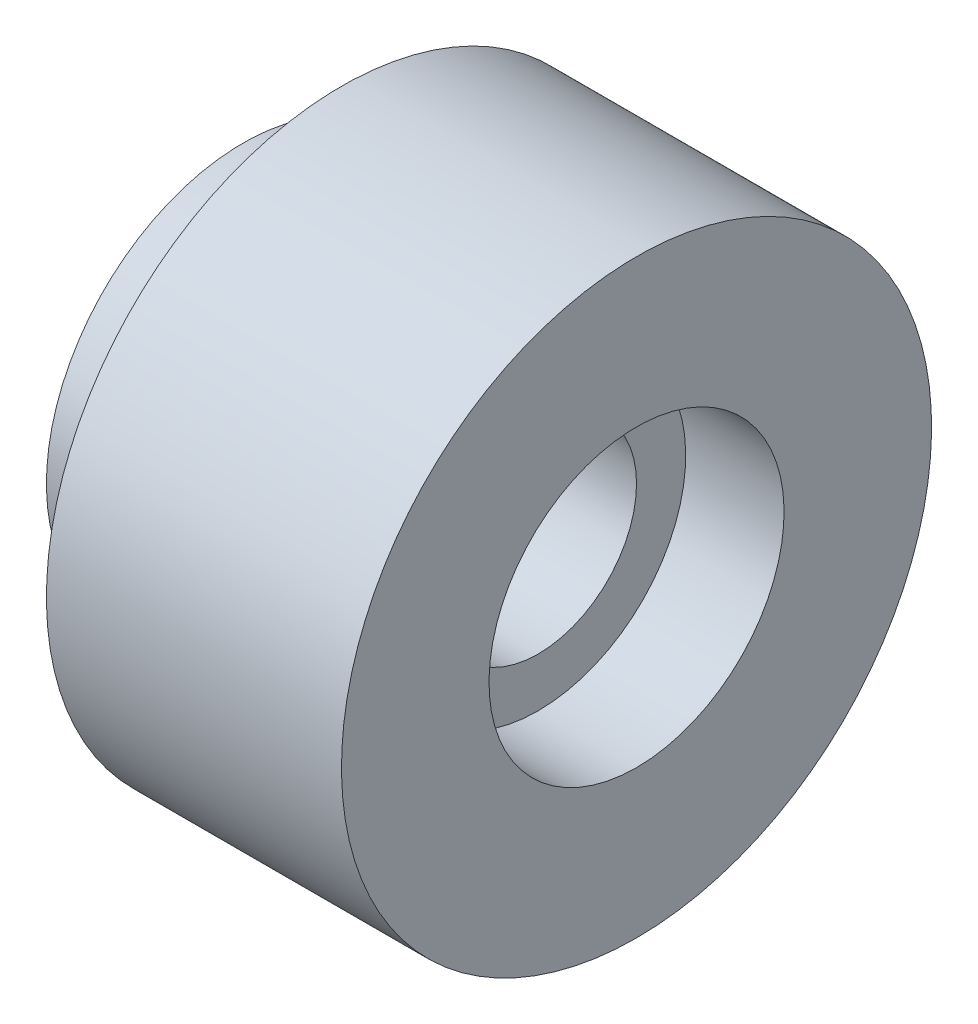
ISO-10303-21;
HEADER;
FILE_DESCRIPTION(('STEP AP214'),'2;1');
FILE_NAME('part.step','',(''),(''),'','','');
FILE_SCHEMA(('AUTOMOTIVE_DESIGN { 1 0 10303 214 1 1 1 1 }'));
ENDSEC;
DATA;
#1=APPLICATION_CONTEXT('core data for automotive mechanical design processes');
#2=APPLICATION_PROTOCOL_DEFINITION('international standard','automotive_design',2000,#1);
#3=PRODUCT_CONTEXT('',#1,'mechanical');
#4=PRODUCT('Part','Part','',(#3));
#5=PRODUCT_RELATED_PRODUCT_CATEGORY('part','',(#4));
#6=PRODUCT_DEFINITION_FORMATION('','',#4);
#7=PRODUCT_DEFINITION_CONTEXT('part definition',#1,'design');
#8=PRODUCT_DEFINITION('design','',#6,#7);
#9=PRODUCT_DEFINITION_SHAPE('','',#8);
#10=(LENGTH_UNIT() NAMED_UNIT(*) SI_UNIT(.MILLI.,.METRE.));
#11=(NAMED_UNIT(*) PLANE_ANGLE_UNIT() SI_UNIT($,.RADIAN.));
#12=(NAMED_UNIT(*) SI_UNIT($,.STERADIAN.) SOLID_ANGLE_UNIT());
#13=UNCERTAINTY_MEASURE_WITH_UNIT(LENGTH_MEASURE(1.E-05),#10,'distance_accuracy_value','');
#14=(GEOMETRIC_REPRESENTATION_CONTEXT(3) GLOBAL_UNCERTAINTY_ASSIGNED_CONTEXT((#13)) GLOBAL_UNIT_ASSIGNED_CONTEXT((#10,
#11,#12)) REPRESENTATION_CONTEXT('',''));
#15=CARTESIAN_POINT('',(0.,0.,0.));
#16=DIRECTION('',(0.,0.,1.));
#17=DIRECTION('',(1.,0.,0.));
#18=AXIS2_PLACEMENT_3D('',#15,#16,#17);
#19=CARTESIAN_POINT('',(0.,0.,0.));
#20=DIRECTION('',(-1.,0.,0.));
#21=DIRECTION('',(0.,-1.,0.));
#22=AXIS2_PLACEMENT_3D('',#19,#20,#21);
#23=CYLINDRICAL_SURFACE('',#22,10.);
#24=CARTESIAN_POINT('',(0.,0.,0.));
#25=DIRECTION('',(-1.,0.,0.));
#26=DIRECTION('',(0.,-1.,0.));
#27=AXIS2_PLACEMENT_3D('',#24,#25,#26);
#28=CIRCLE('',#27,10.);
#29=CARTESIAN_POINT('',(0.,-10.,0.));
#30=VERTEX_POINT('',#29);
#31=EDGE_CURVE('E10',#30,#30,#28,.T.);
#32=ORIENTED_EDGE('',*,*,#31,.F.);
#33=EDGE_LOOP('',(#32));
#34=FACE_BOUND('',#33,.T.);
#35=CARTESIAN_POINT('',(5.,0.,0.));
#36=DIRECTION('',(-1.,0.,0.));
#37=DIRECTION('',(0.,-1.,0.));
#38=AXIS2_PLACEMENT_3D('',#35,#36,#37);
#39=CIRCLE('',#38,10.);
#40=CARTESIAN_POINT('',(5.,-10.,0.));
#41=VERTEX_POINT('',#40);
#42=EDGE_CURVE('E58',#41,#41,#39,.T.);
#43=ORIENTED_EDGE('',*,*,#42,.T.);
#44=EDGE_LOOP('',(#43));
#45=FACE_BOUND('',#44,.T.);
#46=ADVANCED_FACE('F30',(#34,#45),#23,.T.);
#47=CARTESIAN_POINT('',(0.,5.,0.));
#48=DIRECTION('',(1.,0.,0.));
#49=DIRECTION('',(0.,1.,0.));
#50=AXIS2_PLACEMENT_3D('',#47,#48,#49);
#51=PLANE('',#50);
#52=CARTESIAN_POINT('',(0.,0.,0.));
#53=DIRECTION('',(-1.,0.,0.));
#54=DIRECTION('',(0.,-1.,0.));
#55=AXIS2_PLACEMENT_3D('',#52,#53,#54);
#56=CIRCLE('',#55,5.);
#57=CARTESIAN_POINT('',(0.,-5.,0.));
#58=VERTEX_POINT('',#57);
#59=EDGE_CURVE('E36',#58,#58,#56,.T.);
#60=ORIENTED_EDGE('',*,*,#59,.F.);
#61=EDGE_LOOP('',(#60));
#62=FACE_BOUND('',#61,.T.);
#63=ORIENTED_EDGE('',*,*,#31,.T.);
#64=EDGE_LOOP('',(#63));
#65=FACE_BOUND('',#64,.T.);
#66=ADVANCED_FACE('F95',(#62,#65),#51,.F.);
#67=CARTESIAN_POINT('',(0.,0.,0.));
#68=DIRECTION('',(-1.,0.,0.));
#69=DIRECTION('',(0.,-1.,0.));
#70=AXIS2_PLACEMENT_3D('',#67,#68,#69);
#71=CYLINDRICAL_SURFACE('',#70,5.);
#72=CARTESIAN_POINT('',(15.,0.,0.));
#73=DIRECTION('',(-1.,0.,0.));
#74=DIRECTION('',(0.,-1.,0.));
#75=AXIS2_PLACEMENT_3D('',#72,#73,#74);
#76=CIRCLE('',#75,5.);
#77=CARTESIAN_POINT('',(15.,-5.,0.));
#78=VERTEX_POINT('',#77);
#79=EDGE_CURVE('E40',#78,#78,#76,.T.);
#80=ORIENTED_EDGE('',*,*,#79,.F.);
#81=EDGE_LOOP('',(#80));
#82=FACE_BOUND('',#81,.T.);
#83=ORIENTED_EDGE('',*,*,#59,.T.);
#84=EDGE_LOOP('',(#83));
#85=FACE_BOUND('',#84,.T.);
#86=ADVANCED_FACE('F90',(#82,#85),#71,.F.);
#87=CARTESIAN_POINT('',(15.,7.5,0.));
#88=DIRECTION('',(-1.,0.,0.));
#89=DIRECTION('',(0.,-1.,0.));
#90=AXIS2_PLACEMENT_3D('',#87,#88,#89);
#91=PLANE('',#90);
#92=CARTESIAN_POINT('',(15.,0.,0.));
#93=DIRECTION('',(-1.,0.,0.));
#94=DIRECTION('',(0.,-1.,0.));
#95=AXIS2_PLACEMENT_3D('',#92,#93,#94);
#96=CIRCLE('',#95,7.5);
#97=CARTESIAN_POINT('',(15.,-7.5,0.));
#98=VERTEX_POINT('',#97);
#99=EDGE_CURVE('E44',#98,#98,#96,.T.);
#100=ORIENTED_EDGE('',*,*,#99,.F.);
#101=EDGE_LOOP('',(#100));
#102=FACE_BOUND('',#101,.T.);
#103=ORIENTED_EDGE('',*,*,#79,.T.);
#104=EDGE_LOOP('',(#103));
#105=FACE_BOUND('',#104,.T.);
#106=ADVANCED_FACE('F84',(#102,#105),#91,.F.);
#107=CARTESIAN_POINT('',(0.,0.,0.));
#108=DIRECTION('',(-1.,0.,0.));
#109=DIRECTION('',(0.,-1.,0.));
#110=AXIS2_PLACEMENT_3D('',#107,#108,#109);
#111=CYLINDRICAL_SURFACE('',#110,7.5);
#112=CARTESIAN_POINT('',(20.,0.,0.));
#113=DIRECTION('',(-1.,0.,0.));
#114=DIRECTION('',(0.,-1.,0.));
#115=AXIS2_PLACEMENT_3D('',#112,#113,#114);
#116=CIRCLE('',#115,7.5);
#117=CARTESIAN_POINT('',(20.,-7.5,0.));
#118=VERTEX_POINT('',#117);
#119=EDGE_CURVE('E49',#118,#118,#116,.T.);
#120=ORIENTED_EDGE('',*,*,#119,.F.);
#121=EDGE_LOOP('',(#120));
#122=FACE_BOUND('',#121,.T.);
#123=ORIENTED_EDGE('',*,*,#99,.T.);
#124=EDGE_LOOP('',(#123));
#125=FACE_BOUND('',#124,.T.);
#126=ADVANCED_FACE('F78',(#122,#125),#111,.F.);
#127=CARTESIAN_POINT('',(20.,15.,0.));
#128=DIRECTION('',(-1.,0.,0.));
#129=DIRECTION('',(0.,-1.,0.));
#130=AXIS2_PLACEMENT_3D('',#127,#128,#129);
#131=PLANE('',#130);
#132=CARTESIAN_POINT('',(20.,0.,0.));
#133=DIRECTION('',(-1.,0.,0.));
#134=DIRECTION('',(0.,-1.,0.));
#135=AXIS2_PLACEMENT_3D('',#132,#133,#134);
#136=CIRCLE('',#135,15.);
#137=CARTESIAN_POINT('',(20.,-15.,0.));
#138=VERTEX_POINT('',#137);
#139=EDGE_CURVE('E52',#138,#138,#136,.T.);
#140=ORIENTED_EDGE('',*,*,#139,.F.);
#141=EDGE_LOOP('',(#140));
#142=FACE_BOUND('',#141,.T.);
#143=ORIENTED_EDGE('',*,*,#119,.T.);
#144=EDGE_LOOP('',(#143));
#145=FACE_BOUND('',#144,.T.);
#146=ADVANCED_FACE('F72',(#142,#145),#131,.F.);
#147=CARTESIAN_POINT('',(0.,0.,0.));
#148=DIRECTION('',(-1.,0.,0.));
#149=DIRECTION('',(0.,-1.,0.));
#150=AXIS2_PLACEMENT_3D('',#147,#148,#149);
#151=CYLINDRICAL_SURFACE('',#150,15.);
#152=CARTESIAN_POINT('',(5.,0.,0.));
#153=DIRECTION('',(-1.,0.,0.));
#154=DIRECTION('',(0.,-1.,0.));
#155=AXIS2_PLACEMENT_3D('',#152,#153,#154);
#156=CIRCLE('',#155,15.);
#157=CARTESIAN_POINT('',(5.,-15.,0.));
#158=VERTEX_POINT('',#157);
#159=EDGE_CURVE('E55',#158,#158,#156,.T.);
#160=ORIENTED_EDGE('',*,*,#159,.F.);
#161=EDGE_LOOP('',(#160));
#162=FACE_BOUND('',#161,.T.);
#163=ORIENTED_EDGE('',*,*,#139,.T.);
#164=EDGE_LOOP('',(#163));
#165=FACE_BOUND('',#164,.T.);
#166=ADVANCED_FACE('F66',(#162,#165),#151,.T.);
#167=CARTESIAN_POINT('',(5.,10.,0.));
#168=DIRECTION('',(1.,0.,0.));
#169=DIRECTION('',(0.,1.,0.));
#170=AXIS2_PLACEMENT_3D('',#167,#168,#169);
#171=PLANE('',#170);
#172=ORIENTED_EDGE('',*,*,#42,.F.);
#173=EDGE_LOOP('',(#172));
#174=FACE_BOUND('',#173,.T.);
#175=ORIENTED_EDGE('',*,*,#159,.T.);
#176=EDGE_LOOP('',(#175));
#177=FACE_BOUND('',#176,.T.);
#178=ADVANCED_FACE('F63',(#174,#177),#171,.F.);
#179=CLOSED_SHELL('',(#46,#66,#86,#106,#126,#146,#166,#178));
#180=MANIFOLD_SOLID_BREP('B2',#179);
#181=ADVANCED_BREP_SHAPE_REPRESENTATION('',(#18,#180),#14);
#182=SHAPE_DEFINITION_REPRESENTATION(#9,#181);
ENDSEC;
END-ISO-10303-21;
